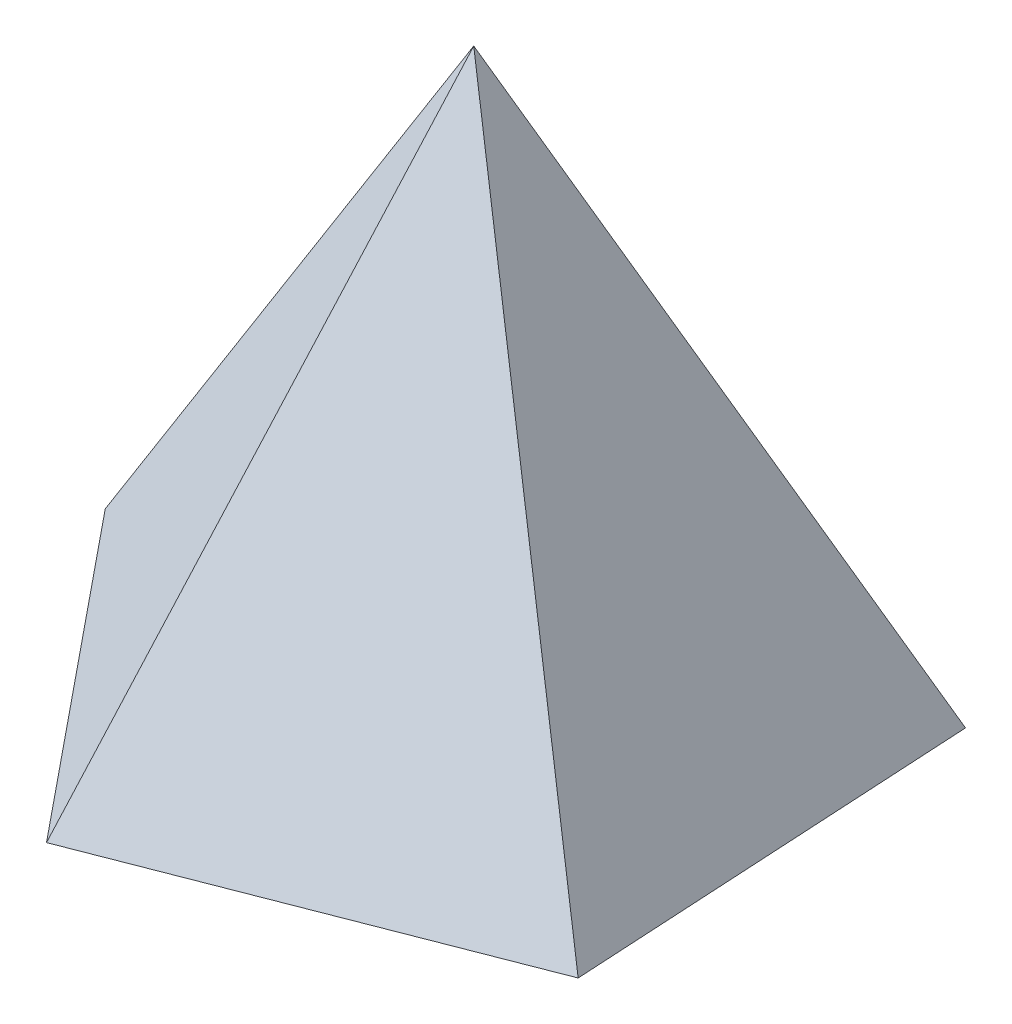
ISO-10303-21;
HEADER;
FILE_DESCRIPTION(('STEP AP214'),'2;1');
FILE_NAME('part.step','',(''),(''),'','','');
FILE_SCHEMA(('AUTOMOTIVE_DESIGN { 1 0 10303 214 1 1 1 1 }'));
ENDSEC;
DATA;
#1=APPLICATION_CONTEXT('core data for automotive mechanical design processes');
#2=APPLICATION_PROTOCOL_DEFINITION('international standard','automotive_design',2000,#1);
#3=PRODUCT_CONTEXT('',#1,'mechanical');
#4=PRODUCT('Part','Part','',(#3));
#5=PRODUCT_RELATED_PRODUCT_CATEGORY('part','',(#4));
#6=PRODUCT_DEFINITION_FORMATION('','',#4);
#7=PRODUCT_DEFINITION_CONTEXT('part definition',#1,'design');
#8=PRODUCT_DEFINITION('design','',#6,#7);
#9=PRODUCT_DEFINITION_SHAPE('','',#8);
#10=(LENGTH_UNIT() NAMED_UNIT(*) SI_UNIT(.MILLI.,.METRE.));
#11=(NAMED_UNIT(*) PLANE_ANGLE_UNIT() SI_UNIT($,.RADIAN.));
#12=(NAMED_UNIT(*) SI_UNIT($,.STERADIAN.) SOLID_ANGLE_UNIT());
#13=UNCERTAINTY_MEASURE_WITH_UNIT(LENGTH_MEASURE(1.E-05),#10,'distance_accuracy_value','');
#14=(GEOMETRIC_REPRESENTATION_CONTEXT(3) GLOBAL_UNCERTAINTY_ASSIGNED_CONTEXT((#13)) GLOBAL_UNIT_ASSIGNED_CONTEXT((#10,
#11,#12)) REPRESENTATION_CONTEXT('',''));
#15=CARTESIAN_POINT('',(0.,0.,0.));
#16=DIRECTION('',(0.,0.,1.));
#17=DIRECTION('',(1.,0.,0.));
#18=AXIS2_PLACEMENT_3D('',#15,#16,#17);
#19=CARTESIAN_POINT('',(0.,0.,0.));
#20=DIRECTION('',(0.,1.,0.));
#21=DIRECTION('',(0.,0.,1.));
#22=AXIS2_PLACEMENT_3D('',#19,#20,#21);
#23=PLANE('',#22);
#24=DIRECTION('',(0.932337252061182,0.,-0.361589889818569));
#25=VECTOR('',#24,1.);
#26=CARTESIAN_POINT('',(-15.7896387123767,0.,59.7523842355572));
#27=LINE('',#26,#25);
#28=CARTESIAN_POINT('',(-15.7896387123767,0.,59.7523842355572));
#29=VERTEX_POINT('',#28);
#30=CARTESIAN_POINT('',(51.9486276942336,0.,33.4813409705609));
#31=VERTEX_POINT('',#30);
#32=EDGE_CURVE('E92',#29,#31,#27,.T.);
#33=ORIENTED_EDGE('',*,*,#32,.F.);
#34=DIRECTION('',(0.632000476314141,0.,0.774967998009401));
#35=VECTOR('',#34,1.);
#36=CARTESIAN_POINT('',(-61.7071610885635,0.,3.44766339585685));
#37=LINE('',#36,#35);
#38=CARTESIAN_POINT('',(-61.7071610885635,0.,3.44766339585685));
#39=VERTEX_POINT('',#38);
#40=EDGE_CURVE('E154',#39,#29,#37,.T.);
#41=ORIENTED_EDGE('',*,*,#40,.F.);
#42=DIRECTION('',(-0.541739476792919,0.,0.84054645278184));
#43=VECTOR('',#42,1.);
#44=CARTESIAN_POINT('',(-22.3474841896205,0.,-57.6216110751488));
#45=LINE('',#44,#43);
#46=CARTESIAN_POINT('',(-22.3474841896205,0.,-57.6216110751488));
#47=VERTEX_POINT('',#46);
#48=EDGE_CURVE('E198',#47,#39,#45,.T.);
#49=ORIENTED_EDGE('',*,*,#48,.F.);
#50=DIRECTION('',(-0.96681388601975,0.,-0.255481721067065));
#51=VECTOR('',#50,1.);
#52=CARTESIAN_POINT('',(47.8956562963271,0.,-39.0597775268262));
#53=LINE('',#52,#51);
#54=CARTESIAN_POINT('',(47.8956562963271,0.,-39.0597775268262));
#55=VERTEX_POINT('',#54);
#56=EDGE_CURVE('E94',#55,#47,#53,.T.);
#57=ORIENTED_EDGE('',*,*,#56,.F.);
#58=DIRECTION('',(-0.0557843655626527,0.,-0.998442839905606));
#59=VECTOR('',#58,1.);
#60=CARTESIAN_POINT('',(51.9486276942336,0.,33.4813409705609));
#61=LINE('',#60,#59);
#62=EDGE_CURVE('E90',#31,#55,#61,.T.);
#63=ORIENTED_EDGE('',*,*,#62,.F.);
#64=EDGE_LOOP('',(#33,#41,#49,#57,#63));
#65=FACE_BOUND('',#64,.T.);
#66=ADVANCED_FACE('F52',(#65),#23,.F.);
#67=CARTESIAN_POINT('',(-33.6218581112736,20.,-21.6695790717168));
#68=DIRECTION('',(-0.751807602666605,0.447213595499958,-0.484546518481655));
#69=DIRECTION('',(-0.541739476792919,0.,0.84054645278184));
#70=AXIS2_PLACEMENT_3D('',#67,#68,#69);
#71=PLANE('',#70);
#72=DIRECTION('',(-0.190099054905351,-0.85065080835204,-0.490158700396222));
#73=VECTOR('',#72,1.);
#74=CARTESIAN_POINT('',(0.,100.,0.));
#75=LINE('',#74,#73);
#76=CARTESIAN_POINT('',(0.,100.,0.));
#77=VERTEX_POINT('',#76);
#78=EDGE_CURVE('E151',#77,#47,#75,.T.);
#79=ORIENTED_EDGE('',*,*,#78,.T.);
#80=ORIENTED_EDGE('',*,*,#48,.T.);
#81=DIRECTION('',(-0.524912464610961,-0.85065080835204,0.0293275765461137));
#82=VECTOR('',#81,1.);
#83=CARTESIAN_POINT('',(0.,100.,0.));
#84=LINE('',#83,#82);
#85=EDGE_CURVE('E114',#77,#39,#84,.T.);
#86=ORIENTED_EDGE('',*,*,#85,.F.);
#87=EDGE_LOOP('',(#79,#80,#86));
#88=FACE_BOUND('',#87,.T.);
#89=ADVANCED_FACE('F160',(#88),#71,.T.);
#90=CARTESIAN_POINT('',(-30.998719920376,20.,25.2800190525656));
#91=DIRECTION('',(-0.693152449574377,0.447213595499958,0.565278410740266));
#92=DIRECTION('',(0.632000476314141,0.,0.774967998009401));
#93=AXIS2_PLACEMENT_3D('',#90,#91,#92);
#94=PLANE('',#93);
#95=ORIENTED_EDGE('',*,*,#85,.T.);
#96=ORIENTED_EDGE('',*,*,#40,.T.);
#97=DIRECTION('',(-0.134314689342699,-0.85065080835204,0.508284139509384));
#98=VECTOR('',#97,1.);
#99=CARTESIAN_POINT('',(0.,100.,0.));
#100=LINE('',#99,#98);
#101=EDGE_CURVE('E12',#77,#29,#100,.T.);
#102=ORIENTED_EDGE('',*,*,#101,.F.);
#103=EDGE_LOOP('',(#95,#96,#102));
#104=FACE_BOUND('',#103,.T.);
#105=ADVANCED_FACE('F133',(#104),#94,.T.);
#106=CARTESIAN_POINT('',(10.2192688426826,20.,-38.67255544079));
#107=DIRECTION('',(0.228509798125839,0.447213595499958,-0.864744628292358));
#108=DIRECTION('',(0.,0.888246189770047,0.459367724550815));
#109=AXIS2_PLACEMENT_3D('',#106,#107,#108);
#110=PLANE('',#109);
#111=DIRECTION('',(0.407424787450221,-0.85065080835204,-0.332262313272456));
#112=VECTOR('',#111,1.);
#113=CARTESIAN_POINT('',(0.,100.,0.));
#114=LINE('',#113,#112);
#115=EDGE_CURVE('E109',#77,#55,#114,.T.);
#116=ORIENTED_EDGE('',*,*,#115,.T.);
#117=ORIENTED_EDGE('',*,*,#56,.T.);
#118=ORIENTED_EDGE('',*,*,#78,.F.);
#119=EDGE_LOOP('',(#116,#117,#118));
#120=FACE_BOUND('',#119,.T.);
#121=ADVANCED_FACE('F129',(#120),#110,.T.);
#122=CARTESIAN_POINT('',(39.9377135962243,20.,-2.23137462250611));
#123=DIRECTION('',(0.89303442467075,0.447213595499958,-0.0498950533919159));
#124=DIRECTION('',(-0.447771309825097,0.894148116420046,0.));
#125=AXIS2_PLACEMENT_3D('',#122,#123,#124);
#126=PLANE('',#125);
#127=DIRECTION('',(0.441901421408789,-0.85065080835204,0.284809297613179));
#128=VECTOR('',#127,1.);
#129=CARTESIAN_POINT('',(0.,100.,0.));
#130=LINE('',#129,#128);
#131=EDGE_CURVE('E65',#77,#31,#130,.T.);
#132=ORIENTED_EDGE('',*,*,#131,.T.);
#133=ORIENTED_EDGE('',*,*,#62,.T.);
#134=ORIENTED_EDGE('',*,*,#115,.F.);
#135=EDGE_LOOP('',(#132,#133,#134));
#136=FACE_BOUND('',#135,.T.);
#137=ADVANCED_FACE('F108',(#136),#126,.T.);
#138=CARTESIAN_POINT('',(14.4635955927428,20.,37.2934900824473));
#139=DIRECTION('',(0.323415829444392,0.447213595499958,0.833907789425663));
#140=DIRECTION('',(0.,-0.881269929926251,0.472613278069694));
#141=AXIS2_PLACEMENT_3D('',#138,#139,#140);
#142=PLANE('',#141);
#143=ORIENTED_EDGE('',*,*,#101,.T.);
#144=ORIENTED_EDGE('',*,*,#32,.T.);
#145=ORIENTED_EDGE('',*,*,#131,.F.);
#146=EDGE_LOOP('',(#143,#144,#145));
#147=FACE_BOUND('',#146,.T.);
#148=ADVANCED_FACE('F54',(#147),#142,.T.);
#149=CLOSED_SHELL('',(#66,#89,#105,#121,#137,#148));
#150=MANIFOLD_SOLID_BREP('B2',#149);
#151=ADVANCED_BREP_SHAPE_REPRESENTATION('',(#18,#150),#14);
#152=SHAPE_DEFINITION_REPRESENTATION(#9,#151);
ENDSEC;
END-ISO-10303-21;
